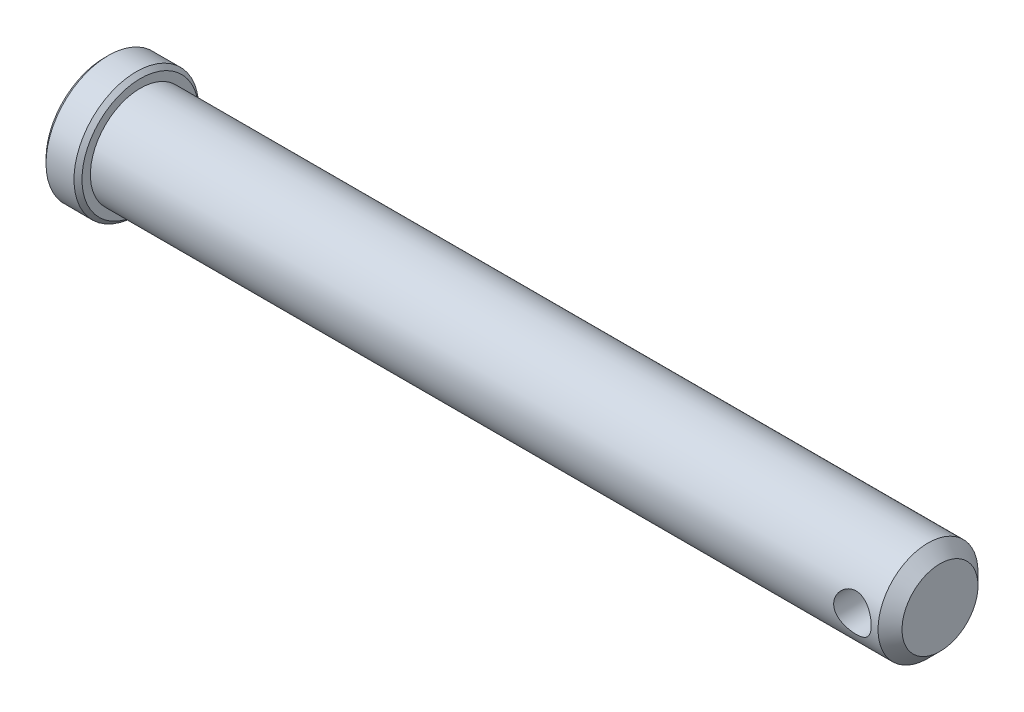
ISO-10303-21;
HEADER;
FILE_DESCRIPTION(('STEP AP214'),'2;1');
FILE_NAME('part.step','',(''),(''),'','','');
FILE_SCHEMA(('AUTOMOTIVE_DESIGN { 1 0 10303 214 1 1 1 1 }'));
ENDSEC;
DATA;
#1=APPLICATION_CONTEXT('core data for automotive mechanical design processes');
#2=APPLICATION_PROTOCOL_DEFINITION('international standard','automotive_design',2000,#1);
#3=PRODUCT_CONTEXT('',#1,'mechanical');
#4=PRODUCT('Part','Part','',(#3));
#5=PRODUCT_RELATED_PRODUCT_CATEGORY('part','',(#4));
#6=PRODUCT_DEFINITION_FORMATION('','',#4);
#7=PRODUCT_DEFINITION_CONTEXT('part definition',#1,'design');
#8=PRODUCT_DEFINITION('design','',#6,#7);
#9=PRODUCT_DEFINITION_SHAPE('','',#8);
#10=(LENGTH_UNIT() NAMED_UNIT(*) SI_UNIT(.MILLI.,.METRE.));
#11=(NAMED_UNIT(*) PLANE_ANGLE_UNIT() SI_UNIT($,.RADIAN.));
#12=(NAMED_UNIT(*) SI_UNIT($,.STERADIAN.) SOLID_ANGLE_UNIT());
#13=UNCERTAINTY_MEASURE_WITH_UNIT(LENGTH_MEASURE(1.E-05),#10,'distance_accuracy_value','');
#14=(GEOMETRIC_REPRESENTATION_CONTEXT(3) GLOBAL_UNCERTAINTY_ASSIGNED_CONTEXT((#13)) GLOBAL_UNIT_ASSIGNED_CONTEXT((#10,
#11,#12)) REPRESENTATION_CONTEXT('',''));
#15=CARTESIAN_POINT('',(0.,0.,0.));
#16=DIRECTION('',(0.,0.,1.));
#17=DIRECTION('',(1.,0.,0.));
#18=AXIS2_PLACEMENT_3D('',#15,#16,#17);
#19=CARTESIAN_POINT('',(0.,0.,0.));
#20=DIRECTION('',(-1.,0.,0.));
#21=DIRECTION('',(0.,0.,1.));
#22=AXIS2_PLACEMENT_3D('',#19,#20,#21);
#23=PLANE('',#22);
#24=CARTESIAN_POINT('',(0.,0.,0.));
#25=DIRECTION('',(-1.,0.,0.));
#26=DIRECTION('',(0.,0.,1.));
#27=AXIS2_PLACEMENT_3D('',#24,#25,#26);
#28=CIRCLE('',#27,3.7084);
#29=CARTESIAN_POINT('',(0.,0.,3.7084));
#30=VERTEX_POINT('',#29);
#31=EDGE_CURVE('E10',#30,#30,#28,.T.);
#32=ORIENTED_EDGE('',*,*,#31,.T.);
#33=EDGE_LOOP('',(#32));
#34=FACE_BOUND('',#33,.T.);
#35=ADVANCED_FACE('F30',(#34),#23,.T.);
#36=CARTESIAN_POINT('',(0.,0.,0.));
#37=DIRECTION('',(1.,0.,0.));
#38=DIRECTION('',(0.,0.,-1.));
#39=AXIS2_PLACEMENT_3D('',#36,#37,#38);
#40=CYLINDRICAL_SURFACE('',#39,3.9624);
#41=CARTESIAN_POINT('',(2.032,0.,0.));
#42=DIRECTION('',(1.,0.,0.));
#43=DIRECTION('',(0.,0.,-1.));
#44=AXIS2_PLACEMENT_3D('',#41,#42,#43);
#45=CIRCLE('',#44,3.9624);
#46=CARTESIAN_POINT('',(2.032,0.,-3.9624));
#47=VERTEX_POINT('',#46);
#48=EDGE_CURVE('E36',#47,#47,#45,.F.);
#49=ORIENTED_EDGE('',*,*,#48,.T.);
#50=EDGE_LOOP('',(#49));
#51=FACE_BOUND('',#50,.T.);
#52=CARTESIAN_POINT('',(0.254000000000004,0.,0.));
#53=DIRECTION('',(-1.,0.,0.));
#54=DIRECTION('',(0.,0.,1.));
#55=AXIS2_PLACEMENT_3D('',#52,#53,#54);
#56=CIRCLE('',#55,3.9624);
#57=CARTESIAN_POINT('',(0.254000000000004,0.,3.9624));
#58=VERTEX_POINT('',#57);
#59=EDGE_CURVE('E40',#58,#58,#56,.F.);
#60=ORIENTED_EDGE('',*,*,#59,.T.);
#61=EDGE_LOOP('',(#60));
#62=FACE_BOUND('',#61,.T.);
#63=ADVANCED_FACE('F88',(#51,#62),#40,.T.);
#64=CARTESIAN_POINT('',(2.286,3.96240000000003,0.));
#65=DIRECTION('',(1.,0.,0.));
#66=DIRECTION('',(0.,0.,-1.));
#67=AXIS2_PLACEMENT_3D('',#64,#65,#66);
#68=PLANE('',#67);
#69=CARTESIAN_POINT('',(2.286,0.,0.));
#70=DIRECTION('',(1.,0.,0.));
#71=DIRECTION('',(0.,0.,-1.));
#72=AXIS2_PLACEMENT_3D('',#69,#70,#71);
#73=CIRCLE('',#72,3.7084);
#74=CARTESIAN_POINT('',(2.286,0.,-3.7084));
#75=VERTEX_POINT('',#74);
#76=EDGE_CURVE('E44',#75,#75,#73,.T.);
#77=ORIENTED_EDGE('',*,*,#76,.T.);
#78=EDGE_LOOP('',(#77));
#79=FACE_BOUND('',#78,.T.);
#80=CARTESIAN_POINT('',(2.286,0.,0.));
#81=DIRECTION('',(1.,0.,0.));
#82=DIRECTION('',(0.,0.,-1.));
#83=AXIS2_PLACEMENT_3D('',#80,#81,#82);
#84=CIRCLE('',#83,3.175);
#85=CARTESIAN_POINT('',(2.286,0.,-3.175));
#86=VERTEX_POINT('',#85);
#87=EDGE_CURVE('E55',#86,#86,#84,.T.);
#88=ORIENTED_EDGE('',*,*,#87,.F.);
#89=EDGE_LOOP('',(#88));
#90=FACE_BOUND('',#89,.T.);
#91=ADVANCED_FACE('F85',(#79,#90),#68,.T.);
#92=CARTESIAN_POINT('',(0.,0.,0.));
#93=DIRECTION('',(1.,0.,0.));
#94=DIRECTION('',(0.,0.,-1.));
#95=AXIS2_PLACEMENT_3D('',#92,#93,#94);
#96=CYLINDRICAL_SURFACE('',#95,3.175);
#97=CARTESIAN_POINT('',(52.324,0.,0.));
#98=DIRECTION('',(1.,0.,0.));
#99=DIRECTION('',(0.,0.,-1.));
#100=AXIS2_PLACEMENT_3D('',#97,#98,#99);
#101=CIRCLE('',#100,3.175);
#102=CARTESIAN_POINT('',(52.324,0.,-3.175));
#103=VERTEX_POINT('',#102);
#104=EDGE_CURVE('E49',#103,#103,#101,.F.);
#105=ORIENTED_EDGE('',*,*,#104,.T.);
#106=EDGE_LOOP('',(#105));
#107=FACE_BOUND('',#106,.T.);
#108=CARTESIAN_POINT('',(49.5046,0.,-3.175));
#109=CARTESIAN_POINT('',(49.5045976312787,0.0646400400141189,-3.17500177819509));
#110=CARTESIAN_POINT('',(49.5098664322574,0.129263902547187,-3.17300883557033));
#111=CARTESIAN_POINT('',(49.5307165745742,0.256579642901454,-3.16525786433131));
#112=CARTESIAN_POINT('',(49.5462963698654,0.319271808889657,-3.15950040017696));
#113=CARTESIAN_POINT('',(49.5871391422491,0.440869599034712,-3.14483818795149));
#114=CARTESIAN_POINT('',(49.6123833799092,0.499782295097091,-3.1359395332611));
#115=CARTESIAN_POINT('',(49.6717428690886,0.612532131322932,-3.11588073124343));
#116=CARTESIAN_POINT('',(49.7058605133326,0.666367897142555,-3.10471997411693));
#117=CARTESIAN_POINT('',(49.7835184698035,0.769732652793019,-3.08075651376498));
#118=CARTESIAN_POINT('',(49.8273707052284,0.819016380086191,-3.06790717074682));
#119=CARTESIAN_POINT('',(49.9225908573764,0.909727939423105,-3.04224365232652));
#120=CARTESIAN_POINT('',(49.9739610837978,0.951153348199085,-3.02942948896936));
#121=CARTESIAN_POINT('',(50.085160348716,1.02653622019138,-3.0047437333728));
#122=CARTESIAN_POINT('',(50.145238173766,1.06014649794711,-2.99292711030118));
#123=CARTESIAN_POINT('',(50.2707079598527,1.11667675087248,-2.97230050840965));
#124=CARTESIAN_POINT('',(50.3360977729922,1.13960102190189,-2.96348932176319));
#125=CARTESIAN_POINT('',(50.4675116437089,1.17313910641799,-2.95037011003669));
#126=CARTESIAN_POINT('',(50.5333985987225,1.18422115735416,-2.9458915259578));
#127=CARTESIAN_POINT('',(50.6662374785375,1.19522418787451,-2.94144571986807));
#128=CARTESIAN_POINT('',(50.7331889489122,1.19514980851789,-2.94147662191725));
#129=CARTESIAN_POINT('',(50.8619637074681,1.18420001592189,-2.94589929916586));
#130=CARTESIAN_POINT('',(50.9238530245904,1.17397528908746,-2.95002835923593));
#131=CARTESIAN_POINT('',(51.0449626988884,1.14409109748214,-2.96174533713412));
#132=CARTESIAN_POINT('',(51.1041826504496,1.12443020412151,-2.96933377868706));
#133=CARTESIAN_POINT('',(51.2195949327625,1.07587608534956,-2.98727199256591));
#134=CARTESIAN_POINT('',(51.2757084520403,1.04681469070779,-2.99767144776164));
#135=CARTESIAN_POINT('',(51.3824507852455,0.980401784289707,-3.02004351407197));
#136=CARTESIAN_POINT('',(51.4330776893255,0.943047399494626,-3.03201666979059));
#137=CARTESIAN_POINT('',(51.5310098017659,0.858135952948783,-3.05717427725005));
#138=CARTESIAN_POINT('',(51.5778591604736,0.810059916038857,-3.07038590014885));
#139=CARTESIAN_POINT('',(51.6629665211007,0.706582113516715,-3.09583635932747));
#140=CARTESIAN_POINT('',(51.7012231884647,0.651179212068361,-3.1080750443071));
#141=CARTESIAN_POINT('',(51.7685655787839,0.533452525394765,-3.1304462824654));
#142=CARTESIAN_POINT('',(51.7974987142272,0.471034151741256,-3.1405429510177));
#143=CARTESIAN_POINT('',(51.8443022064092,0.341741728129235,-3.15722612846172));
#144=CARTESIAN_POINT('',(51.8621775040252,0.274869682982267,-3.16381420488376));
#145=CARTESIAN_POINT('',(51.885479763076,0.142404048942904,-3.17246196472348));
#146=CARTESIAN_POINT('',(51.8915205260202,0.0769328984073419,-3.1747446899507));
#147=CARTESIAN_POINT('',(51.8927704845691,-0.0541198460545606,-3.17521433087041));
#148=CARTESIAN_POINT('',(51.8879820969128,-0.119701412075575,-3.17340216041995));
#149=CARTESIAN_POINT('',(51.8681756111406,-0.24645583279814,-3.16603272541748));
#150=CARTESIAN_POINT('',(51.8535602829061,-0.307701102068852,-3.16062300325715));
#151=CARTESIAN_POINT('',(51.8150458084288,-0.42682653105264,-3.14675118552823));
#152=CARTESIAN_POINT('',(51.7911454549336,-0.484706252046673,-3.13828869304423));
#153=CARTESIAN_POINT('',(51.7339762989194,-0.597367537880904,-3.11883678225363));
#154=CARTESIAN_POINT('',(51.7004523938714,-0.652007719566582,-3.10778030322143));
#155=CARTESIAN_POINT('',(51.6252759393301,-0.7550705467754,-3.08436235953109));
#156=CARTESIAN_POINT('',(51.5836203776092,-0.803490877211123,-3.07200041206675));
#157=CARTESIAN_POINT('',(51.4905040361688,-0.895694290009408,-3.04643707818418));
#158=CARTESIAN_POINT('',(51.4386130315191,-0.939042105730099,-3.03322878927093));
#159=CARTESIAN_POINT('',(51.3280347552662,-1.0165015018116,-3.00815757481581));
#160=CARTESIAN_POINT('',(51.2693468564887,-1.05061222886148,-2.99629477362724));
#161=CARTESIAN_POINT('',(51.1463414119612,-1.10867017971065,-2.97530463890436));
#162=CARTESIAN_POINT('',(51.0820005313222,-1.13257263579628,-2.96618940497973));
#163=CARTESIAN_POINT('',(50.9497683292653,-1.16904599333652,-2.95200725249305));
#164=CARTESIAN_POINT('',(50.8818792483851,-1.18162395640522,-2.94693781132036));
#165=CARTESIAN_POINT('',(50.74919703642,-1.19445850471,-2.94175750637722));
#166=CARTESIAN_POINT('',(50.6844868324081,-1.19545783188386,-2.94134776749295));
#167=CARTESIAN_POINT('',(50.5558720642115,-1.18701146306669,-2.94476640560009));
#168=CARTESIAN_POINT('',(50.4919674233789,-1.17756676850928,-2.94859437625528));
#169=CARTESIAN_POINT('',(50.368779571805,-1.14907988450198,-2.95980777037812));
#170=CARTESIAN_POINT('',(50.3094146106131,-1.13034274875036,-2.96707980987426));
#171=CARTESIAN_POINT('',(50.194636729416,-1.08407220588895,-2.98429535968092));
#172=CARTESIAN_POINT('',(50.1392248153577,-1.05653656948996,-2.99423954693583));
#173=CARTESIAN_POINT('',(50.0307554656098,-0.99176947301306,-3.01632989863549));
#174=CARTESIAN_POINT('',(49.9779753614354,-0.954104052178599,-3.02856439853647));
#175=CARTESIAN_POINT('',(49.8792476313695,-0.870816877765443,-3.05355394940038));
#176=CARTESIAN_POINT('',(49.8333021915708,-0.825192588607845,-3.06630916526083));
#177=CARTESIAN_POINT('',(49.7469934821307,-0.724309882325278,-3.09173834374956));
#178=CARTESIAN_POINT('',(49.7070711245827,-0.668661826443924,-3.10436996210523));
#179=CARTESIAN_POINT('',(49.6371568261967,-0.551002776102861,-3.1273969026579));
#180=CARTESIAN_POINT('',(49.6071657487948,-0.488991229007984,-3.13779203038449));
#181=CARTESIAN_POINT('',(49.557066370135,-0.357344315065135,-3.15555557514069));
#182=CARTESIAN_POINT('',(49.537470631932,-0.28749031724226,-3.16276450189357));
#183=CARTESIAN_POINT('',(49.5112420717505,-0.145083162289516,-3.17248452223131));
#184=CARTESIAN_POINT('',(49.5046026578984,-0.0725313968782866,-3.17499800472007));
#185=CARTESIAN_POINT('',(49.5046,0.,-3.175));
#186=B_SPLINE_CURVE_WITH_KNOTS('',3,(#108,#109,#110,#111,#112,#113,#114,#115,#116,#117,#118,
#119,#120,#121,#122,#123,#124,#125,#126,#127,#128,#129,#130,#131,#132,#133,#134,#135,#136,#137,
#138,#139,#140,#141,#142,#143,#144,#145,#146,#147,#148,#149,#150,#151,#152,#153,#154,#155,#156,
#157,#158,#159,#160,#161,#162,#163,#164,#165,#166,#167,#168,#169,#170,#171,#172,#173,#174,#175,
#176,#177,#178,#179,#180,#181,#182,#183,#184,#185),.UNSPECIFIED.,.T.,.F.,(4,2,2,2,2,2,2,2,2,2,2,
2,2,2,2,2,2,2,2,2,2,2,2,2,2,2,2,2,2,2,2,2,2,2,2,2,2,2,4),(0.,0.193652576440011,
0.387276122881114,0.580526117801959,0.773828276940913,0.974564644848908,1.17536281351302,
1.38385903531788,1.59227136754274,1.79209792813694,1.99184136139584,2.1795566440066,
2.36730035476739,2.55860793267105,2.74998189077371,2.95429179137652,3.15863340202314,
3.36616689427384,3.57360758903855,3.7699703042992,3.96628920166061,4.15501595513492,
4.34376725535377,4.53807563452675,4.73245612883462,4.9381754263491,5.14391372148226,
5.35054522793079,5.55704779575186,5.75022437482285,5.9433824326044,6.13058190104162,
6.31782883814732,6.51492895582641,6.71209198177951,6.92000438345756,7.12793485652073,
7.34533948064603,7.56263346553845),.UNSPECIFIED.);
#187=CARTESIAN_POINT('',(49.5046,0.,-3.175));
#188=VERTEX_POINT('',#187);
#189=EDGE_CURVE('E56',#188,#188,#186,.T.);
#190=ORIENTED_EDGE('',*,*,#189,.F.);
#191=EDGE_LOOP('',(#190));
#192=FACE_BOUND('',#191,.T.);
#193=CARTESIAN_POINT('',(51.8922,0.,3.17500000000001));
#194=CARTESIAN_POINT('',(51.8922023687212,0.0646400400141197,3.17500177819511));
#195=CARTESIAN_POINT('',(51.8869335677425,0.129263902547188,3.17300883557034));
#196=CARTESIAN_POINT('',(51.8660834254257,0.256579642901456,3.16525786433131));
#197=CARTESIAN_POINT('',(51.8505036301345,0.319271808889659,3.15950040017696));
#198=CARTESIAN_POINT('',(51.8096608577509,0.440869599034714,3.14483818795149));
#199=CARTESIAN_POINT('',(51.7844166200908,0.499782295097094,3.1359395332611));
#200=CARTESIAN_POINT('',(51.7250571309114,0.612532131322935,3.11588073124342));
#201=CARTESIAN_POINT('',(51.6909394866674,0.666367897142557,3.10471997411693));
#202=CARTESIAN_POINT('',(51.6132815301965,0.769732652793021,3.08075651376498));
#203=CARTESIAN_POINT('',(51.5694292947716,0.819016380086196,3.06790717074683));
#204=CARTESIAN_POINT('',(51.4742091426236,0.909727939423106,3.04224365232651));
#205=CARTESIAN_POINT('',(51.4228389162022,0.951153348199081,3.02942948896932));
#206=CARTESIAN_POINT('',(51.311639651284,1.02653622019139,3.00474373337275));
#207=CARTESIAN_POINT('',(51.251561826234,1.06014649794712,2.99292711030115));
#208=CARTESIAN_POINT('',(51.1260920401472,1.11667675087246,2.97230050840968));
#209=CARTESIAN_POINT('',(51.0607022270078,1.13960102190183,2.96348932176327));
#210=CARTESIAN_POINT('',(50.9292883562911,1.17313910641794,2.95037011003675));
#211=CARTESIAN_POINT('',(50.8634014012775,1.18422115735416,2.94589152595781));
#212=CARTESIAN_POINT('',(50.7305625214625,1.19522418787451,2.94144571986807));
#213=CARTESIAN_POINT('',(50.6636110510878,1.19514980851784,2.94147662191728));
#214=CARTESIAN_POINT('',(50.5348362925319,1.18420001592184,2.9458992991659));
#215=CARTESIAN_POINT('',(50.4729469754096,1.17397528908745,2.95002835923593));
#216=CARTESIAN_POINT('',(50.3518373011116,1.14409109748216,2.96174533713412));
#217=CARTESIAN_POINT('',(50.2926173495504,1.12443020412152,2.96933377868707));
#218=CARTESIAN_POINT('',(50.1772050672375,1.07587608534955,2.98727199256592));
#219=CARTESIAN_POINT('',(50.1210915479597,1.04681469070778,2.99767144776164));
#220=CARTESIAN_POINT('',(50.0143492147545,0.980401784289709,3.02004351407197));
#221=CARTESIAN_POINT('',(49.9637223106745,0.943047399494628,3.0320166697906));
#222=CARTESIAN_POINT('',(49.8657901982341,0.858135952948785,3.05717427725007));
#223=CARTESIAN_POINT('',(49.8189408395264,0.810059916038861,3.07038590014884));
#224=CARTESIAN_POINT('',(49.7338334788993,0.70658211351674,3.09583635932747));
#225=CARTESIAN_POINT('',(49.6955768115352,0.651179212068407,3.10807504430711));
#226=CARTESIAN_POINT('',(49.628234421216,0.533452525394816,3.13044628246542));
#227=CARTESIAN_POINT('',(49.5993012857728,0.471034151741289,3.14054295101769));
#228=CARTESIAN_POINT('',(49.5524977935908,0.341741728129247,3.15722612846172));
#229=CARTESIAN_POINT('',(49.5346224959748,0.274869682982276,3.16381420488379));
#230=CARTESIAN_POINT('',(49.511320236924,0.142404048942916,3.17246196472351));
#231=CARTESIAN_POINT('',(49.5052794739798,0.0769328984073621,3.1747446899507));
#232=CARTESIAN_POINT('',(49.5040295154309,-0.0541198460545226,3.17521433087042));
#233=CARTESIAN_POINT('',(49.5088179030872,-0.119701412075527,3.17340216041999));
#234=CARTESIAN_POINT('',(49.5286243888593,-0.246455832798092,3.16603272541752));
#235=CARTESIAN_POINT('',(49.5432397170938,-0.307701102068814,3.16062300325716));
#236=CARTESIAN_POINT('',(49.5817541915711,-0.426826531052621,3.14675118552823));
#237=CARTESIAN_POINT('',(49.6056545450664,-0.484706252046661,3.13828869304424));
#238=CARTESIAN_POINT('',(49.6628237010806,-0.597367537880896,3.11883678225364));
#239=CARTESIAN_POINT('',(49.6963476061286,-0.652007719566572,3.10778030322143));
#240=CARTESIAN_POINT('',(49.7715240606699,-0.755070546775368,3.0843623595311));
#241=CARTESIAN_POINT('',(49.8131796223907,-0.803490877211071,3.07200041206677));
#242=CARTESIAN_POINT('',(49.9062959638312,-0.895694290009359,3.04643707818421));
#243=CARTESIAN_POINT('',(49.9581869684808,-0.939042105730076,3.03322878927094));
#244=CARTESIAN_POINT('',(50.0687652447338,-1.0165015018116,3.00815757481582));
#245=CARTESIAN_POINT('',(50.1274531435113,-1.05061222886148,2.99629477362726));
#246=CARTESIAN_POINT('',(50.2504585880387,-1.10867017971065,2.97530463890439));
#247=CARTESIAN_POINT('',(50.3147994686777,-1.13257263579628,2.96618940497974));
#248=CARTESIAN_POINT('',(50.4470316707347,-1.16904599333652,2.95200725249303));
#249=CARTESIAN_POINT('',(50.5149207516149,-1.18162395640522,2.94693781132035));
#250=CARTESIAN_POINT('',(50.64760296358,-1.19445850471,2.94175750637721));
#251=CARTESIAN_POINT('',(50.7123131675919,-1.19545783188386,2.94134776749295));
#252=CARTESIAN_POINT('',(50.8409279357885,-1.18701146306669,2.94476640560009));
#253=CARTESIAN_POINT('',(50.9048325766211,-1.17756676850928,2.94859437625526));
#254=CARTESIAN_POINT('',(51.0280204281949,-1.14907988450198,2.95980777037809));
#255=CARTESIAN_POINT('',(51.0873853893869,-1.13034274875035,2.96707980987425));
#256=CARTESIAN_POINT('',(51.2021632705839,-1.08407220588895,2.98429535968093));
#257=CARTESIAN_POINT('',(51.2575751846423,-1.05653656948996,2.99423954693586));
#258=CARTESIAN_POINT('',(51.3660445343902,-0.991769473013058,3.01632989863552));
#259=CARTESIAN_POINT('',(51.4188246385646,-0.954104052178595,3.02856439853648));
#260=CARTESIAN_POINT('',(51.5175523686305,-0.870816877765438,3.05355394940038));
#261=CARTESIAN_POINT('',(51.5634978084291,-0.825192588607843,3.06630916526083));
#262=CARTESIAN_POINT('',(51.6498065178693,-0.724309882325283,3.09173834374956));
#263=CARTESIAN_POINT('',(51.6897288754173,-0.668661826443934,3.10436996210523));
#264=CARTESIAN_POINT('',(51.7596431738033,-0.55100277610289,3.12739690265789));
#265=CARTESIAN_POINT('',(51.7896342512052,-0.488991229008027,3.13779203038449));
#266=CARTESIAN_POINT('',(51.839733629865,-0.357344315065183,3.15555557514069));
#267=CARTESIAN_POINT('',(51.8593293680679,-0.287490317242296,3.16276450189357));
#268=CARTESIAN_POINT('',(51.8855579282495,-0.145083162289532,3.17248452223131));
#269=CARTESIAN_POINT('',(51.8921973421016,-0.0725313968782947,3.17499800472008));
#270=CARTESIAN_POINT('',(51.8922,0.,3.17500000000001));
#271=B_SPLINE_CURVE_WITH_KNOTS('',3,(#193,#194,#195,#196,#197,#198,#199,#200,#201,#202,#203,
#204,#205,#206,#207,#208,#209,#210,#211,#212,#213,#214,#215,#216,#217,#218,#219,#220,#221,#222,
#223,#224,#225,#226,#227,#228,#229,#230,#231,#232,#233,#234,#235,#236,#237,#238,#239,#240,#241,
#242,#243,#244,#245,#246,#247,#248,#249,#250,#251,#252,#253,#254,#255,#256,#257,#258,#259,#260,
#261,#262,#263,#264,#265,#266,#267,#268,#269,#270),.UNSPECIFIED.,.T.,.F.,(4,2,2,2,2,2,2,2,2,2,2,
2,2,2,2,2,2,2,2,2,2,2,2,2,2,2,2,2,2,2,2,2,2,2,2,2,2,2,4),(0.,0.193652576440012,
0.387276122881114,0.580526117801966,0.773828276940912,0.974564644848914,1.17536281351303,
1.38385903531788,1.59227136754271,1.79209792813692,1.99184136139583,2.17955664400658,
2.36730035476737,2.55860793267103,2.74998189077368,2.95429179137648,3.15863340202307,
3.3661668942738,3.57360758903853,3.76997030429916,3.96628920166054,4.15501595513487,
4.34376725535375,4.5380756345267,4.73245612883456,4.93817542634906,5.14391372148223,
5.35054522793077,5.55704779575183,5.75022437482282,5.94338243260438,6.1305819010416,
6.31782883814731,6.51492895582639,6.71209198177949,6.92000438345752,7.12793485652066,
7.34533948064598,7.56263346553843),.UNSPECIFIED.);
#272=CARTESIAN_POINT('',(51.8922,0.,3.17500000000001));
#273=VERTEX_POINT('',#272);
#274=EDGE_CURVE('E63',#273,#273,#271,.T.);
#275=ORIENTED_EDGE('',*,*,#274,.F.);
#276=EDGE_LOOP('',(#275));
#277=FACE_BOUND('',#276,.T.);
#278=ORIENTED_EDGE('',*,*,#87,.T.);
#279=EDGE_LOOP('',(#278));
#280=FACE_BOUND('',#279,.T.);
#281=ADVANCED_FACE('F67',(#107,#192,#277,#280),#96,.T.);
#282=CARTESIAN_POINT('',(53.086,3.17499999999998,0.));
#283=DIRECTION('',(1.,0.,0.));
#284=DIRECTION('',(0.,0.,-1.));
#285=AXIS2_PLACEMENT_3D('',#282,#283,#284);
#286=PLANE('',#285);
#287=CARTESIAN_POINT('',(53.086,0.,0.));
#288=DIRECTION('',(1.,0.,0.));
#289=DIRECTION('',(0.,0.,-1.));
#290=AXIS2_PLACEMENT_3D('',#287,#288,#289);
#291=CIRCLE('',#290,2.41299999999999);
#292=CARTESIAN_POINT('',(53.086,0.,-2.41299999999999));
#293=VERTEX_POINT('',#292);
#294=EDGE_CURVE('E52',#293,#293,#291,.T.);
#295=ORIENTED_EDGE('',*,*,#294,.T.);
#296=EDGE_LOOP('',(#295));
#297=FACE_BOUND('',#296,.T.);
#298=ADVANCED_FACE('F76',(#297),#286,.T.);
#299=CARTESIAN_POINT('',(50.6984,0.,-3.96239999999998));
#300=DIRECTION('',(0.,0.,1.));
#301=DIRECTION('',(1.,0.,0.));
#302=AXIS2_PLACEMENT_3D('',#299,#300,#301);
#303=CYLINDRICAL_SURFACE('',#302,1.1938);
#304=ORIENTED_EDGE('',*,*,#189,.T.);
#305=EDGE_LOOP('',(#304));
#306=FACE_BOUND('',#305,.T.);
#307=ORIENTED_EDGE('',*,*,#274,.T.);
#308=EDGE_LOOP('',(#307));
#309=FACE_BOUND('',#308,.T.);
#310=ADVANCED_FACE('F71',(#306,#309),#303,.F.);
#311=CARTESIAN_POINT('',(53.086,0.,0.));
#312=DIRECTION('',(-1.,0.,0.));
#313=DIRECTION('',(0.,0.,1.));
#314=AXIS2_PLACEMENT_3D('',#311,#312,#313);
#315=CONICAL_SURFACE('',#314,2.41299999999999,0.785398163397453);
#316=ORIENTED_EDGE('',*,*,#104,.F.);
#317=EDGE_LOOP('',(#316));
#318=FACE_BOUND('',#317,.T.);
#319=ORIENTED_EDGE('',*,*,#294,.F.);
#320=EDGE_LOOP('',(#319));
#321=FACE_BOUND('',#320,.T.);
#322=ADVANCED_FACE('F75',(#318,#321),#315,.T.);
#323=CARTESIAN_POINT('',(2.286,0.,0.));
#324=DIRECTION('',(-1.,0.,0.));
#325=DIRECTION('',(0.,0.,1.));
#326=AXIS2_PLACEMENT_3D('',#323,#324,#325);
#327=CONICAL_SURFACE('',#326,3.7084,0.785398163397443);
#328=ORIENTED_EDGE('',*,*,#48,.F.);
#329=EDGE_LOOP('',(#328));
#330=FACE_BOUND('',#329,.T.);
#331=ORIENTED_EDGE('',*,*,#76,.F.);
#332=EDGE_LOOP('',(#331));
#333=FACE_BOUND('',#332,.T.);
#334=ADVANCED_FACE('F101',(#330,#333),#327,.T.);
#335=CARTESIAN_POINT('',(0.254000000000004,0.,0.));
#336=DIRECTION('',(1.,0.,0.));
#337=DIRECTION('',(0.,0.,-1.));
#338=AXIS2_PLACEMENT_3D('',#335,#336,#337);
#339=CONICAL_SURFACE('',#338,3.9624,0.785398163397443);
#340=ORIENTED_EDGE('',*,*,#31,.F.);
#341=EDGE_LOOP('',(#340));
#342=FACE_BOUND('',#341,.T.);
#343=ORIENTED_EDGE('',*,*,#59,.F.);
#344=EDGE_LOOP('',(#343));
#345=FACE_BOUND('',#344,.T.);
#346=ADVANCED_FACE('F99',(#342,#345),#339,.T.);
#347=CLOSED_SHELL('',(#35,#63,#91,#281,#298,#310,#322,#334,#346));
#348=MANIFOLD_SOLID_BREP('B2',#347);
#349=ADVANCED_BREP_SHAPE_REPRESENTATION('',(#18,#348),#14);
#350=SHAPE_DEFINITION_REPRESENTATION(#9,#349);
ENDSEC;
END-ISO-10303-21;
